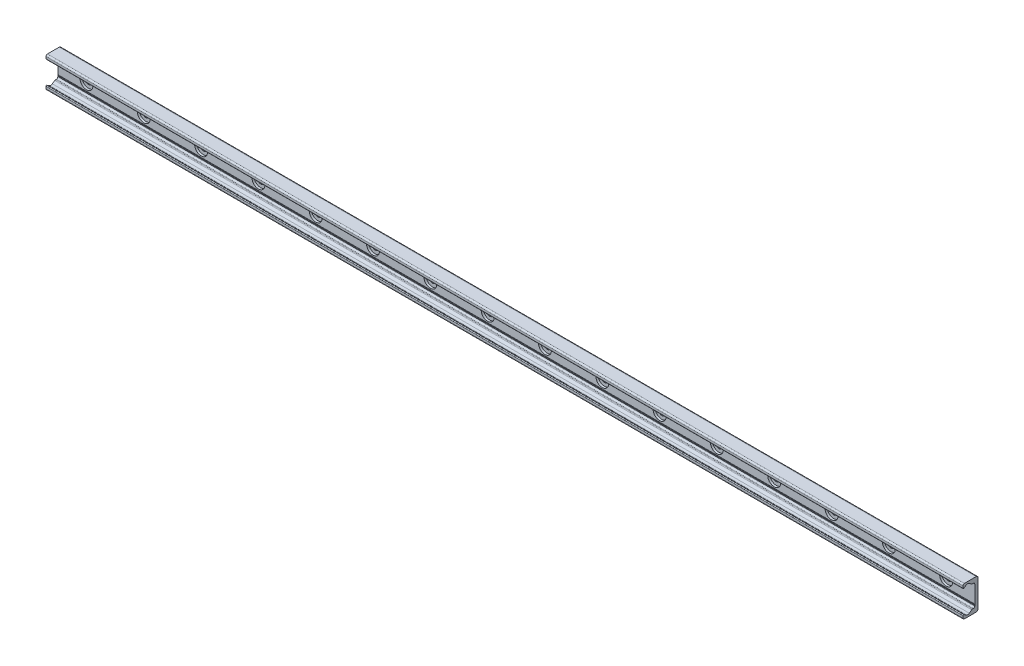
from build123d import *

# Parameters (mm, degrees)
BOSS_EXTRUDE1_DEPTH = 640
SKETCH2_R           = 9
SKETCH2_R_2         = 4.5
CUT_EXTRUDE1_DEPTH  = 3.1
SKETCH2_2_R         = 4.5
CUT_EXTRUDE2_DEPTH  = 641.573571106
LPATTERN1_COUNT     = 16
LPATTERN1_PITCH     = 80


with BuildPart() as part:
    # Sketch1 → Boss-Extrude1 (new, symmetric)
    with BuildSketch(Plane(origin=(0, 0, 0), x_dir=(0, 0, -1), z_dir=(1, 0, 0))):
        with BuildLine():
            Line((0, 0), (0, 19))
            ThreePointArc((0, 19), (-0.732233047, 20.767766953), (-2.5, 21.5))
            Line((-2.5, 21.5), (-19, 21.5))
            ThreePointArc((-19, 21.5), (-20.414213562, 20.914213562), (-21, 19.5))
            Line((-21, 19.5), (-21, 16.625057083))
            ThreePointArc((-21, 16.625057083), (-20.553251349, 15.888838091), (-19.693931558, 15.945160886))
            Line((-19.693931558, 15.945160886), (-16.794305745, 17.975500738))
            ThreePointArc((-16.794305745, 17.975500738), (-14.5, 18.69889256), (-12.205694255, 17.975500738))
            Line((-12.205694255, 17.975500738), (-8.829831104, 15.611695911))
            ThreePointArc((-8.829831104, 15.611695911), (-8.28408983, 15.342566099), (-7.682678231, 15.25))
            Line((-7.682678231, 15.25), (-6.5, 15.25))
            ThreePointArc((-6.5, 15.25), (-5.085786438, 14.664213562), (-4.5, 13.25))
            Line((-4.5, 13.25), (-4.5, -10.75))
            ThreePointArc((-4.5, -10.75), (-4.25, -11), (-4.5, -11.25))
            Line((-4.5, -11.25), (-4.5, -12.25))
            ThreePointArc((-4.5, -12.25), (-4.25, -12.5), (-4.5, -12.75))
            Line((-4.5, -12.75), (-4.5, -13.25))
            ThreePointArc((-4.5, -13.25), (-5.085786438, -14.664213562), (-6.5, -15.25))
            Line((-6.5, -15.25), (-7.682678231, -15.25))
            ThreePointArc((-7.682678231, -15.25), (-8.28408983, -15.342566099), (-8.829831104, -15.611695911))
            Line((-8.829831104, -15.611695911), (-12.205694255, -17.975500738))
            ThreePointArc((-12.205694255, -17.975500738), (-14.5, -18.69889256), (-16.794305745, -17.975500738))
            Line((-16.794305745, -17.975500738), (-19.693931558, -15.945160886))
            ThreePointArc((-19.693931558, -15.945160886), (-20.553251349, -15.888838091), (-21, -16.625057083))
            Line((-21, -16.625057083), (-21, -19.5))
            ThreePointArc((-21, -19.5), (-20.414213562, -20.914213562), (-19, -21.5))
            Line((-19, -21.5), (-2.5, -21.5))
            ThreePointArc((-2.5, -21.5), (-0.732233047, -20.767766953), (0, -19))
            Line((0, -19), (0, 0))
        make_face()
    extrude(amount=BOSS_EXTRUDE1_DEPTH, both=True)

    # Sketch2 → Cut-Extrude1 (cut)
    with BuildSketch(Plane.XY.offset(4.5)):
        with Locations((600, 0)):
            Circle(SKETCH2_R)
        with Locations((600, 0)):
            Circle(SKETCH2_R_2, mode=Mode.SUBTRACT)
    cut_extrude1 = extrude(amount=-CUT_EXTRUDE1_DEPTH, mode=Mode.SUBTRACT)

    # Sketch2_2 → Cut-Extrude2 (cut, through all)
    with BuildSketch(Plane.XY.offset(4.5)):
        with Locations((600, 0)):
            Circle(SKETCH2_2_R)
    cut_extrude2 = extrude(amount=-CUT_EXTRUDE2_DEPTH, mode=Mode.SUBTRACT)

    # LPattern1: Cut-Extrude1, Cut-Extrude2 ×16
    with Locations(*[(-i * LPATTERN1_PITCH, 0, 0) for i in range(1, LPATTERN1_COUNT)]):
        add(cut_extrude1, mode=Mode.SUBTRACT)
        add(cut_extrude2, mode=Mode.SUBTRACT)


solid = part.part
